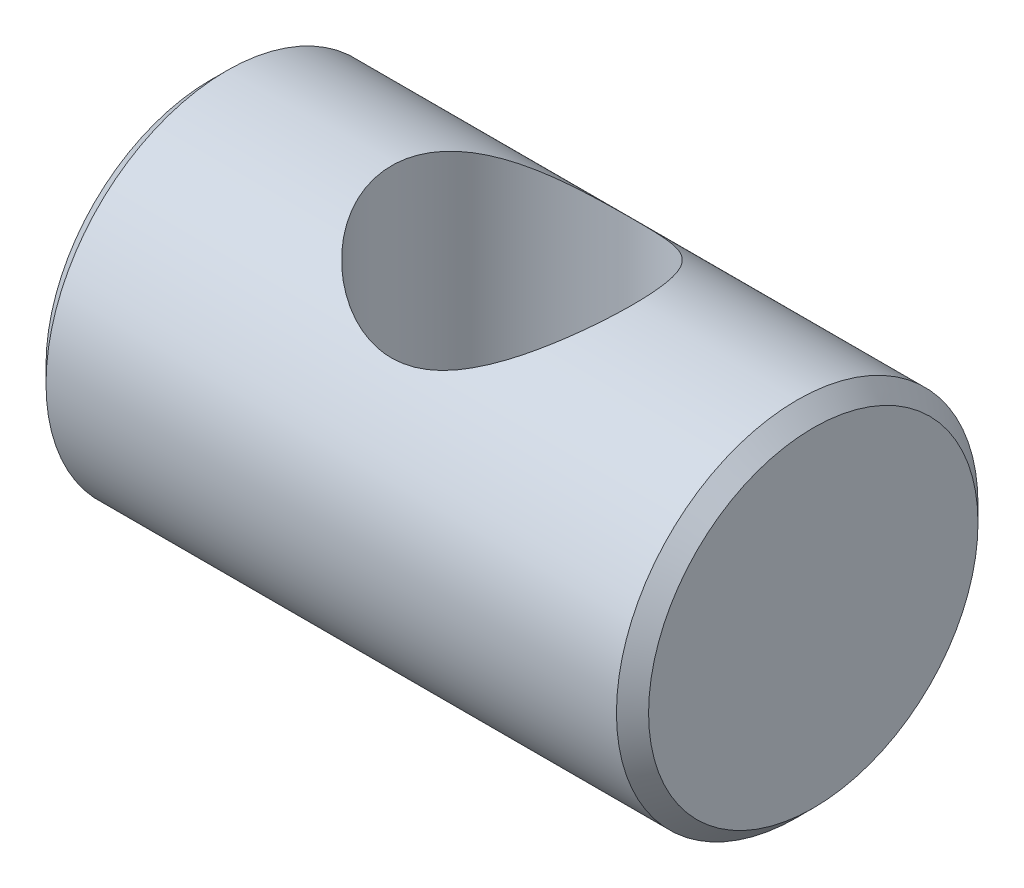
ISO-10303-21;
HEADER;
FILE_DESCRIPTION(('STEP AP214'),'2;1');
FILE_NAME('part.step','',(''),(''),'','','');
FILE_SCHEMA(('AUTOMOTIVE_DESIGN { 1 0 10303 214 1 1 1 1 }'));
ENDSEC;
DATA;
#1=APPLICATION_CONTEXT('core data for automotive mechanical design processes');
#2=APPLICATION_PROTOCOL_DEFINITION('international standard','automotive_design',2000,#1);
#3=PRODUCT_CONTEXT('',#1,'mechanical');
#4=PRODUCT('Part','Part','',(#3));
#5=PRODUCT_RELATED_PRODUCT_CATEGORY('part','',(#4));
#6=PRODUCT_DEFINITION_FORMATION('','',#4);
#7=PRODUCT_DEFINITION_CONTEXT('part definition',#1,'design');
#8=PRODUCT_DEFINITION('design','',#6,#7);
#9=PRODUCT_DEFINITION_SHAPE('','',#8);
#10=(LENGTH_UNIT() NAMED_UNIT(*) SI_UNIT(.MILLI.,.METRE.));
#11=(NAMED_UNIT(*) PLANE_ANGLE_UNIT() SI_UNIT($,.RADIAN.));
#12=(NAMED_UNIT(*) SI_UNIT($,.STERADIAN.) SOLID_ANGLE_UNIT());
#13=UNCERTAINTY_MEASURE_WITH_UNIT(LENGTH_MEASURE(1.E-05),#10,'distance_accuracy_value','');
#14=(GEOMETRIC_REPRESENTATION_CONTEXT(3) GLOBAL_UNCERTAINTY_ASSIGNED_CONTEXT((#13)) GLOBAL_UNIT_ASSIGNED_CONTEXT((#10,
#11,#12)) REPRESENTATION_CONTEXT('',''));
#15=CARTESIAN_POINT('',(0.,0.,0.));
#16=DIRECTION('',(0.,0.,1.));
#17=DIRECTION('',(1.,0.,0.));
#18=AXIS2_PLACEMENT_3D('',#15,#16,#17);
#19=CARTESIAN_POINT('',(7.5,4.1,0.));
#20=DIRECTION('',(-1.,0.,0.));
#21=DIRECTION('',(0.,0.,1.));
#22=AXIS2_PLACEMENT_3D('',#19,#20,#21);
#23=PLANE('',#22);
#24=CARTESIAN_POINT('',(7.49999999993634,0.,0.));
#25=DIRECTION('',(-1.,0.,0.));
#26=DIRECTION('',(0.,0.,1.));
#27=AXIS2_PLACEMENT_3D('',#24,#25,#26);
#28=CIRCLE('',#27,4.099999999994);
#29=CARTESIAN_POINT('',(7.49999999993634,0.,4.099999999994));
#30=VERTEX_POINT('',#29);
#31=EDGE_CURVE('E65',#30,#30,#28,.T.);
#32=ORIENTED_EDGE('',*,*,#31,.F.);
#33=EDGE_LOOP('',(#32));
#34=FACE_BOUND('',#33,.T.);
#35=ADVANCED_FACE('F12',(#34),#23,.F.);
#36=CARTESIAN_POINT('',(-7.5,0.,0.));
#37=DIRECTION('',(1.,0.,0.));
#38=DIRECTION('',(0.,0.,-1.));
#39=AXIS2_PLACEMENT_3D('',#36,#37,#38);
#40=PLANE('',#39);
#41=CARTESIAN_POINT('',(-7.49999999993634,0.,0.));
#42=DIRECTION('',(1.,0.,0.));
#43=DIRECTION('',(0.,0.,-1.));
#44=AXIS2_PLACEMENT_3D('',#41,#42,#43);
#45=CIRCLE('',#44,4.099999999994);
#46=CARTESIAN_POINT('',(-7.49999999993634,0.,-4.099999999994));
#47=VERTEX_POINT('',#46);
#48=EDGE_CURVE('E67',#47,#47,#45,.T.);
#49=ORIENTED_EDGE('',*,*,#48,.F.);
#50=EDGE_LOOP('',(#49));
#51=FACE_BOUND('',#50,.T.);
#52=ADVANCED_FACE('F54',(#51),#40,.F.);
#53=CARTESIAN_POINT('',(7.0999999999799,0.,0.));
#54=DIRECTION('',(-1.,0.,0.));
#55=DIRECTION('',(0.,0.,1.));
#56=AXIS2_PLACEMENT_3D('',#53,#54,#55);
#57=CONICAL_SURFACE('',#56,4.50000000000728,0.785398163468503);
#58=CARTESIAN_POINT('',(7.1,0.,0.));
#59=DIRECTION('',(1.,0.,0.));
#60=DIRECTION('',(0.,0.,-1.));
#61=AXIS2_PLACEMENT_3D('',#58,#59,#60);
#62=CIRCLE('',#61,4.5);
#63=CARTESIAN_POINT('',(7.1,0.,-4.5));
#64=VERTEX_POINT('',#63);
#65=EDGE_CURVE('E31',#64,#64,#62,.F.);
#66=ORIENTED_EDGE('',*,*,#65,.F.);
#67=EDGE_LOOP('',(#66));
#68=FACE_BOUND('',#67,.T.);
#69=ORIENTED_EDGE('',*,*,#31,.T.);
#70=EDGE_LOOP('',(#69));
#71=FACE_BOUND('',#70,.T.);
#72=ADVANCED_FACE('F61',(#68,#71),#57,.T.);
#73=CARTESIAN_POINT('',(-7.09999999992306,0.,0.));
#74=DIRECTION('',(1.,0.,0.));
#75=DIRECTION('',(0.,0.,-1.));
#76=AXIS2_PLACEMENT_3D('',#73,#74,#75);
#77=CONICAL_SURFACE('',#76,4.50000000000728,0.785398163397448);
#78=ORIENTED_EDGE('',*,*,#48,.T.);
#79=EDGE_LOOP('',(#78));
#80=FACE_BOUND('',#79,.T.);
#81=CARTESIAN_POINT('',(-7.1,0.,0.));
#82=DIRECTION('',(1.,0.,0.));
#83=DIRECTION('',(0.,0.,-1.));
#84=AXIS2_PLACEMENT_3D('',#81,#82,#83);
#85=CIRCLE('',#84,4.5);
#86=CARTESIAN_POINT('',(-7.1,0.,-4.5));
#87=VERTEX_POINT('',#86);
#88=EDGE_CURVE('E27',#87,#87,#85,.T.);
#89=ORIENTED_EDGE('',*,*,#88,.F.);
#90=EDGE_LOOP('',(#89));
#91=FACE_BOUND('',#90,.T.);
#92=ADVANCED_FACE('F51',(#80,#91),#77,.T.);
#93=CARTESIAN_POINT('',(7.5,0.,0.));
#94=DIRECTION('',(1.,0.,0.));
#95=DIRECTION('',(0.,0.,-1.));
#96=AXIS2_PLACEMENT_3D('',#93,#94,#95);
#97=CYLINDRICAL_SURFACE('',#96,4.5);
#98=CARTESIAN_POINT('',(3.,-4.5,0.));
#99=CARTESIAN_POINT('',(2.99999813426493,-4.49999851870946,0.15072164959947));
#100=CARTESIAN_POINT('',(2.98857832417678,-4.49236147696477,0.301452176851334));
#101=CARTESIAN_POINT('',(2.94360542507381,-4.46257035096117,0.59810104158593));
#102=CARTESIAN_POINT('',(2.91004182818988,-4.44040937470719,0.744017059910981));
#103=CARTESIAN_POINT('',(2.82283823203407,-4.38375708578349,1.02631807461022));
#104=CARTESIAN_POINT('',(2.76929223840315,-4.34932354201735,1.16274420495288));
#105=CARTESIAN_POINT('',(2.64440500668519,-4.27089210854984,1.42412304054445));
#106=CARTESIAN_POINT('',(2.57306118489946,-4.22689283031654,1.54907407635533));
#107=CARTESIAN_POINT('',(2.40801457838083,-4.12840992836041,1.7959270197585));
#108=CARTESIAN_POINT('',(2.31292820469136,-4.0733534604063,1.9166704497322));
#109=CARTESIAN_POINT('',(2.10640493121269,-3.95973469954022,2.14159207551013));
#110=CARTESIAN_POINT('',(1.99494460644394,-3.90116745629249,2.24574608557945));
#111=CARTESIAN_POINT('',(1.73842144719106,-3.7759239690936,2.45133446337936));
#112=CARTESIAN_POINT('',(1.59083151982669,-3.70942601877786,2.54974779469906));
#113=CARTESIAN_POINT('',(1.2774549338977,-3.58626221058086,2.72025535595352));
#114=CARTESIAN_POINT('',(1.11170039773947,-3.52957943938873,2.79239510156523));
#115=CARTESIAN_POINT('',(0.814933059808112,-3.44964399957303,2.8901105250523));
#116=CARTESIAN_POINT('',(0.687707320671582,-3.42146441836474,2.92311670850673));
#117=CARTESIAN_POINT('',(0.427883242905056,-3.37886954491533,2.97225926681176));
#118=CARTESIAN_POINT('',(0.29529457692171,-3.36443053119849,2.9884247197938));
#119=CARTESIAN_POINT('',(0.0277878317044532,-3.35154908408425,3.002870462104));
#120=CARTESIAN_POINT('',(-0.107137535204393,-3.35317203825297,3.00107764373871));
#121=CARTESIAN_POINT('',(-0.374452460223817,-3.37229663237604,2.97956372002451));
#122=CARTESIAN_POINT('',(-0.506839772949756,-3.3898117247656,2.95982742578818));
#123=CARTESIAN_POINT('',(-0.759700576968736,-3.43690778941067,2.90497491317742));
#124=CARTESIAN_POINT('',(-0.880442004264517,-3.46592232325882,2.87057567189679));
#125=CARTESIAN_POINT('',(-1.11453553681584,-3.53264434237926,2.78805177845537));
#126=CARTESIAN_POINT('',(-1.22788519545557,-3.57035468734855,2.73992260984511));
#127=CARTESIAN_POINT('',(-1.46853809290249,-3.65946294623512,2.62010728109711));
#128=CARTESIAN_POINT('',(-1.59398985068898,-3.7120847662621,2.54562078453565));
#129=CARTESIAN_POINT('',(-1.83207509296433,-3.82037306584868,2.3800344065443));
#130=CARTESIAN_POINT('',(-1.94469248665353,-3.8760432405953,2.28891403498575));
#131=CARTESIAN_POINT('',(-2.17881381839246,-3.9981501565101,2.06971747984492));
#132=CARTESIAN_POINT('',(-2.29700107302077,-4.06432117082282,1.93790907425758));
#133=CARTESIAN_POINT('',(-2.50979474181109,-4.18827150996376,1.65301199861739));
#134=CARTESIAN_POINT('',(-2.60442321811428,-4.24605866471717,1.49994344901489));
#135=CARTESIAN_POINT('',(-2.75021657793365,-4.33718106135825,1.20728674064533));
#136=CARTESIAN_POINT('',(-2.80626504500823,-4.37308891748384,1.07093646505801));
#137=CARTESIAN_POINT('',(-2.89815738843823,-4.43261578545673,0.789054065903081));
#138=CARTESIAN_POINT('',(-2.93401834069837,-4.45624518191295,0.643529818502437));
#139=CARTESIAN_POINT('',(-2.98374174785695,-4.48913823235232,0.346478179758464));
#140=CARTESIAN_POINT('',(-2.99750919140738,-4.49833983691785,0.194927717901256));
#141=CARTESIAN_POINT('',(-3.00187063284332,-4.50124672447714,-0.108662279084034));
#142=CARTESIAN_POINT('',(-2.99246625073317,-4.4949530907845,-0.260701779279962));
#143=CARTESIAN_POINT('',(-2.95256391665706,-4.46849384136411,-0.549683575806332));
#144=CARTESIAN_POINT('',(-2.92359405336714,-4.44933369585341,-0.686936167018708));
#145=CARTESIAN_POINT('',(-2.84760647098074,-4.39977673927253,-0.954174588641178));
#146=CARTESIAN_POINT('',(-2.80058587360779,-4.36937813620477,-1.08415925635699));
#147=CARTESIAN_POINT('',(-2.6870215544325,-4.29744528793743,-1.34199712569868));
#148=CARTESIAN_POINT('',(-2.61946776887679,-4.25534805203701,-1.46924427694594));
#149=CARTESIAN_POINT('',(-2.46835006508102,-4.16402783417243,-1.71102453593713));
#150=CARTESIAN_POINT('',(-2.38477625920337,-4.11480045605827,-1.82554972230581));
#151=CARTESIAN_POINT('',(-2.18908819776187,-4.00431819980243,-2.0577816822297));
#152=CARTESIAN_POINT('',(-2.07455060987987,-3.9423923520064,-2.17312781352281));
#153=CARTESIAN_POINT('',(-1.82833285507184,-3.81856759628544,-2.3840095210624));
#154=CARTESIAN_POINT('',(-1.69664094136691,-3.75666873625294,-2.47953140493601));
#155=CARTESIAN_POINT('',(-1.42928638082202,-3.64409518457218,-2.6418716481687));
#156=CARTESIAN_POINT('',(-1.29490194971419,-3.59291395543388,-2.71043454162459));
#157=CARTESIAN_POINT('',(-1.01419102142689,-3.50158461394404,-2.82744320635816));
#158=CARTESIAN_POINT('',(-0.867886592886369,-3.46141668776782,-2.87592518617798));
#159=CARTESIAN_POINT('',(-0.593153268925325,-3.4039981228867,-2.94353765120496));
#160=CARTESIAN_POINT('',(-0.466242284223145,-3.38392497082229,-2.96637896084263));
#161=CARTESIAN_POINT('',(-0.209140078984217,-3.35819199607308,-2.99548809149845));
#162=CARTESIAN_POINT('',(-0.0789525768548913,-3.35251651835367,-3.00177391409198));
#163=CARTESIAN_POINT('',(0.180964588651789,-3.3564630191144,-2.99735881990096));
#164=CARTESIAN_POINT('',(0.3106939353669,-3.36609405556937,-2.98664784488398));
#165=CARTESIAN_POINT('',(0.566015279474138,-3.39915677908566,-2.94895499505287));
#166=CARTESIAN_POINT('',(0.69160152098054,-3.42260687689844,-2.9219514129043));
#167=CARTESIAN_POINT('',(0.968566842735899,-3.48790269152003,-2.84389536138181));
#168=CARTESIAN_POINT('',(1.11790183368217,-3.53298514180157,-2.78835207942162));
#169=CARTESIAN_POINT('',(1.4032299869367,-3.63333227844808,-2.65626862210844));
#170=CARTESIAN_POINT('',(1.53920405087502,-3.68861122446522,-2.57969896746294));
#171=CARTESIAN_POINT('',(1.79892384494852,-3.80425832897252,-2.40597141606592));
#172=CARTESIAN_POINT('',(1.92240193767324,-3.86470080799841,-2.3084641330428));
#173=CARTESIAN_POINT('',(2.15297989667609,-3.98442252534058,-2.09508703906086));
#174=CARTESIAN_POINT('',(2.26007472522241,-4.04370140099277,-1.97921160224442));
#175=CARTESIAN_POINT('',(2.47008447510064,-4.16448181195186,-1.71214106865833));
#176=CARTESIAN_POINT('',(2.57019292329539,-4.22508104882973,-1.55826365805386));
#177=CARTESIAN_POINT('',(2.69899932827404,-4.30505398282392,-1.31299166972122));
#178=CARTESIAN_POINT('',(2.73837392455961,-4.32988963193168,-1.22882978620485));
#179=CARTESIAN_POINT('',(2.80946645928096,-4.37519698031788,-1.05622318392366));
#180=CARTESIAN_POINT('',(2.8411870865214,-4.39567021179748,-0.967779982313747));
#181=CARTESIAN_POINT('',(2.91169488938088,-4.44149572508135,-0.737227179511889));
#182=CARTESIAN_POINT('',(2.94465665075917,-4.4632644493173,-0.592538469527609));
#183=CARTESIAN_POINT('',(2.98880194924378,-4.49251195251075,-0.298567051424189));
#184=CARTESIAN_POINT('',(3.00000184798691,-4.50000146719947,-0.149287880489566));
#185=CARTESIAN_POINT('',(3.,-4.5,0.));
#186=B_SPLINE_CURVE_WITH_KNOTS('',3,(#98,#99,#100,#101,#102,#103,#104,#105,#106,#107,#108,#109,
#110,#111,#112,#113,#114,#115,#116,#117,#118,#119,#120,#121,#122,#123,#124,#125,#126,#127,#128,
#129,#130,#131,#132,#133,#134,#135,#136,#137,#138,#139,#140,#141,#142,#143,#144,#145,#146,#147,
#148,#149,#150,#151,#152,#153,#154,#155,#156,#157,#158,#159,#160,#161,#162,#163,#164,#165,#166,
#167,#168,#169,#170,#171,#172,#173,#174,#175,#176,#177,#178,#179,#180,#181,#182,#183,#184,#185),
.UNSPECIFIED.,.T.,.F.,(4,2,2,2,2,2,2,2,2,2,2,2,2,2,2,2,2,2,2,2,2,2,2,2,2,2,2,2,2,2,2,2,2,2,2,2,
2,2,2,2,2,2,2,4),(0.,0.4515798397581,0.903374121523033,1.35306922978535,1.8028296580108,
2.29075543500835,2.77938617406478,3.34510024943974,3.90982958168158,4.31150540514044,
4.71248651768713,5.11510067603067,5.51805595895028,5.90323293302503,6.28853675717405,
6.75221362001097,7.21646555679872,7.78078431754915,8.34457260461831,8.79786131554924,
9.25076602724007,9.70561324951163,10.1604286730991,10.583296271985,11.0062313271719,
11.4547852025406,11.9036168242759,12.4234226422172,12.9435862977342,13.419749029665,
13.8950493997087,14.2848607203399,14.6742480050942,15.0638658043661,15.4540038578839,
15.9480991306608,16.4428907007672,16.9466886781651,17.4506412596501,18.0269302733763,
18.3150447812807,18.603057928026,19.0506787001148,19.4979627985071),.UNSPECIFIED.);
#187=CARTESIAN_POINT('',(3.,-4.5,0.));
#188=VERTEX_POINT('',#187);
#189=EDGE_CURVE('E8',#188,#188,#186,.T.);
#190=ORIENTED_EDGE('',*,*,#189,.F.);
#191=EDGE_LOOP('',(#190));
#192=FACE_BOUND('',#191,.T.);
#193=CARTESIAN_POINT('',(0.,3.35410196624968,3.));
#194=CARTESIAN_POINT('',(0.0732569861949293,3.35409414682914,3.00000458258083));
#195=CARTESIAN_POINT('',(0.146481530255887,3.35651144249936,2.99731244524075));
#196=CARTESIAN_POINT('',(0.292242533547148,3.36602370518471,2.98662615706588));
#197=CARTESIAN_POINT('',(0.36477888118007,3.37311941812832,2.97863116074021));
#198=CARTESIAN_POINT('',(0.580557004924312,3.40099728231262,2.94687150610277));
#199=CARTESIAN_POINT('',(0.7218872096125,3.42836960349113,2.91533243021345));
#200=CARTESIAN_POINT('',(0.994135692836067,3.49584414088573,2.83403844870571));
#201=CARTESIAN_POINT('',(1.12514051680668,3.53582228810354,2.78446038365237));
#202=CARTESIAN_POINT('',(1.37678977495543,3.62376255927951,2.66901051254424));
#203=CARTESIAN_POINT('',(1.49743205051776,3.67172634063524,2.60313532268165));
#204=CARTESIAN_POINT('',(1.7454742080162,3.77919120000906,2.44503375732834));
#205=CARTESIAN_POINT('',(1.87100290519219,3.83932601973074,2.35030173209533));
#206=CARTESIAN_POINT('',(2.10599933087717,3.95917042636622,2.14229810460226));
#207=CARTESIAN_POINT('',(2.21545122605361,4.01887953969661,2.02900845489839));
#208=CARTESIAN_POINT('',(2.43098271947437,4.14134123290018,1.76719317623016));
#209=CARTESIAN_POINT('',(2.53429147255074,4.20328759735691,1.61594159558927));
#210=CARTESIAN_POINT('',(2.6683430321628,4.28588873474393,1.37421346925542));
#211=CARTESIAN_POINT('',(2.70954965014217,4.31170810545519,1.29113866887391));
#212=CARTESIAN_POINT('',(2.78442936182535,4.35915144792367,1.12054013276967));
#213=CARTESIAN_POINT('',(2.81810806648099,4.38077854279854,1.03301977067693));
#214=CARTESIAN_POINT('',(2.87404180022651,4.41698044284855,0.864225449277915));
#215=CARTESIAN_POINT('',(2.89715242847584,4.43207302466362,0.78334499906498));
#216=CARTESIAN_POINT('',(2.93658943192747,4.45795195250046,0.619315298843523));
#217=CARTESIAN_POINT('',(2.95291997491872,4.46874094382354,0.536167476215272));
#218=CARTESIAN_POINT('',(2.97850414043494,4.48568768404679,0.368381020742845));
#219=CARTESIAN_POINT('',(2.98776324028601,4.49184901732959,0.28374359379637));
#220=CARTESIAN_POINT('',(2.99905173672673,4.49936633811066,0.11380694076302));
#221=CARTESIAN_POINT('',(3.00108215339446,4.50072300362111,0.0285078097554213));
#222=CARTESIAN_POINT('',(2.99672182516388,4.49781194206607,-0.201115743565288));
#223=CARTESIAN_POINT('',(2.98351119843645,4.48898902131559,-0.345332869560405));
#224=CARTESIAN_POINT('',(2.93686864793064,4.45812769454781,-0.628886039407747));
#225=CARTESIAN_POINT('',(2.90343524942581,4.4360883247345,-0.768221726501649));
#226=CARTESIAN_POINT('',(2.81820508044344,4.38078005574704,-1.03810942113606));
#227=CARTESIAN_POINT('',(2.76648129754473,4.34755581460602,-1.16869392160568));
#228=CARTESIAN_POINT('',(2.64666991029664,4.27231692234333,-1.41931574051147));
#229=CARTESIAN_POINT('',(2.57857931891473,4.2303006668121,-1.53935112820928));
#230=CARTESIAN_POINT('',(2.41803177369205,4.13427076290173,-1.78242579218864));
#231=CARTESIAN_POINT('',(2.32354868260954,4.07940610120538,-1.90378704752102));
#232=CARTESIAN_POINT('',(2.11815201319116,3.9660090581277,-2.12998228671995));
#233=CARTESIAN_POINT('',(2.00721309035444,3.90747110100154,-2.23479025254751));
#234=CARTESIAN_POINT('',(1.75205517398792,3.78225066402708,-2.44158347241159));
#235=CARTESIAN_POINT('',(1.60534337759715,3.71571479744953,-2.54060388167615));
#236=CARTESIAN_POINT('',(1.29373524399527,3.59213416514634,-2.71252313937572));
#237=CARTESIAN_POINT('',(1.12887000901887,3.53507357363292,-2.78546578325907));
#238=CARTESIAN_POINT('',(0.83292140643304,3.45394305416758,-2.88499086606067));
#239=CARTESIAN_POINT('',(0.70560994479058,3.42510546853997,-2.91886187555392));
#240=CARTESIAN_POINT('',(0.445440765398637,3.381135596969,-2.96969333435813));
#241=CARTESIAN_POINT('',(0.312593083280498,3.36597955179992,-2.98668310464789));
#242=CARTESIAN_POINT('',(0.0443355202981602,3.35171335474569,-3.0026910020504));
#243=CARTESIAN_POINT('',(-0.0910829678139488,3.35267300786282,-3.0016309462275));
#244=CARTESIAN_POINT('',(-0.359525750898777,3.37064820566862,-2.98142444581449));
#245=CARTESIAN_POINT('',(-0.492548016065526,3.38767676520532,-2.96226334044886));
#246=CARTESIAN_POINT('',(-0.746084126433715,3.43391966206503,-2.90849716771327));
#247=CARTESIAN_POINT('',(-0.86689156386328,3.46249780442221,-2.87469261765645));
#248=CARTESIAN_POINT('',(-1.10118935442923,3.52844937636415,-2.79334562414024));
#249=CARTESIAN_POINT('',(-1.21467723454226,3.56582575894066,-2.74579856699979));
#250=CARTESIAN_POINT('',(-1.45530300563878,3.65417225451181,-2.6274501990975));
#251=CARTESIAN_POINT('',(-1.5806352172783,3.70636622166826,-2.55390043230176));
#252=CARTESIAN_POINT('',(-1.81862520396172,3.8139377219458,-2.39029097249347));
#253=CARTESIAN_POINT('',(-1.93126727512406,3.86931907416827,-2.30021117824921));
#254=CARTESIAN_POINT('',(-2.16594352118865,3.99113517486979,-2.08314986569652));
#255=CARTESIAN_POINT('',(-2.28465427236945,4.05734178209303,-1.95240579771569));
#256=CARTESIAN_POINT('',(-2.49872502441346,4.18163372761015,-1.6696492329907));
#257=CARTESIAN_POINT('',(-2.59410565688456,4.23972622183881,-1.51765571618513));
#258=CARTESIAN_POINT('',(-2.74183760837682,4.33186231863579,-1.226231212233));
#259=CARTESIAN_POINT('',(-2.79893475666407,4.36838187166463,-1.08999354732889));
#260=CARTESIAN_POINT('',(-2.89291079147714,4.4291806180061,-0.808135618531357));
#261=CARTESIAN_POINT('',(-2.929806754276,4.45347014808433,-0.6625233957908));
#262=CARTESIAN_POINT('',(-2.98154544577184,4.48767546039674,-0.365054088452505));
#263=CARTESIAN_POINT('',(-2.99629001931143,4.49752726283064,-0.213172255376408));
#264=CARTESIAN_POINT('',(-3.00247177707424,4.50164731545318,0.0912833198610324));
#265=CARTESIAN_POINT('',(-2.99391112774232,4.49591701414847,0.243856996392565));
#266=CARTESIAN_POINT('',(-2.95551076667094,4.47044333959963,0.533636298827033));
#267=CARTESIAN_POINT('',(-2.92726352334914,4.45174915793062,0.671152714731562));
#268=CARTESIAN_POINT('',(-2.8526429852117,4.40304159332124,0.939027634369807));
#269=CARTESIAN_POINT('',(-2.80626687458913,4.37302645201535,1.06938502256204));
#270=CARTESIAN_POINT('',(-2.69409194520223,4.3018764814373,1.32772094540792));
#271=CARTESIAN_POINT('',(-2.62732454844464,4.26019873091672,1.45512538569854));
#272=CARTESIAN_POINT('',(-2.47777402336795,4.16963112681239,1.69732899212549));
#273=CARTESIAN_POINT('',(-2.39498131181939,4.1207369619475,1.81212055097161));
#274=CARTESIAN_POINT('',(-2.20105668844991,4.01089395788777,2.04494134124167));
#275=CARTESIAN_POINT('',(-2.08751563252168,3.94925865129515,2.16064022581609));
#276=CARTESIAN_POINT('',(-1.84332951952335,3.82580042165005,2.37240030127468));
#277=CARTESIAN_POINT('',(-1.71267178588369,3.76397739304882,2.46844680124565));
#278=CARTESIAN_POINT('',(-1.44619919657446,3.65076300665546,2.63269891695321));
#279=CARTESIAN_POINT('',(-1.31153938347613,3.59893559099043,2.70247011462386));
#280=CARTESIAN_POINT('',(-1.0300712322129,3.50621323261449,2.82173662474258));
#281=CARTESIAN_POINT('',(-0.883287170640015,3.46529710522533,2.87127132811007));
#282=CARTESIAN_POINT('',(-0.613848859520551,3.40786372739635,2.93904512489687));
#283=CARTESIAN_POINT('',(-0.49305793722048,3.38794856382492,2.96178740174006));
#284=CARTESIAN_POINT('',(-0.248145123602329,3.36107964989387,2.99225476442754));
#285=CARTESIAN_POINT('',(-0.12402606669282,3.35411520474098,2.99999224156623));
#286=CARTESIAN_POINT('',(0.,3.35410196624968,3.));
#287=B_SPLINE_CURVE_WITH_KNOTS('',3,(#193,#194,#195,#196,#197,#198,#199,#200,#201,#202,#203,
#204,#205,#206,#207,#208,#209,#210,#211,#212,#213,#214,#215,#216,#217,#218,#219,#220,#221,#222,
#223,#224,#225,#226,#227,#228,#229,#230,#231,#232,#233,#234,#235,#236,#237,#238,#239,#240,#241,
#242,#243,#244,#245,#246,#247,#248,#249,#250,#251,#252,#253,#254,#255,#256,#257,#258,#259,#260,
#261,#262,#263,#264,#265,#266,#267,#268,#269,#270,#271,#272,#273,#274,#275,#276,#277,#278,#279,
#280,#281,#282,#283,#284,#285,#286),.UNSPECIFIED.,.T.,.F.,(4,2,2,2,2,2,2,2,2,2,2,2,2,2,2,2,2,2,
2,2,2,2,2,2,2,2,2,2,2,2,2,2,2,2,2,2,2,2,2,2,2,2,2,2,2,2,4),(0.,0.219620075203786,
0.439275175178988,0.878823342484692,1.31417375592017,1.749614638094,2.25283493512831,
2.75654755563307,3.33302024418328,3.62140722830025,3.90957854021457,4.16557735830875,
4.42141857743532,4.67706142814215,4.93266820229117,5.36561317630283,5.79858972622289,
6.22985763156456,6.6612043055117,7.14923304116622,7.63802137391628,8.20270070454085,
8.76642719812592,9.16941150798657,9.571694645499,9.97572071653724,10.3800743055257,
10.764666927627,11.1493888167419,11.6110086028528,12.0731935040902,12.636340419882,
13.1989875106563,13.653578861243,14.1077853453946,14.56399859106,15.0201694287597,
15.4431718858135,15.8662400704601,16.3137880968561,16.7616045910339,17.2798532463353,
17.7984879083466,18.2775320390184,18.7556392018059,19.1277693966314,19.4995921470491),.UNSPECIFIED.);
#288=CARTESIAN_POINT('',(0.,3.35410196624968,3.));
#289=VERTEX_POINT('',#288);
#290=EDGE_CURVE('E23',#289,#289,#287,.T.);
#291=ORIENTED_EDGE('',*,*,#290,.F.);
#292=EDGE_LOOP('',(#291));
#293=FACE_BOUND('',#292,.T.);
#294=ORIENTED_EDGE('',*,*,#88,.T.);
#295=EDGE_LOOP('',(#294));
#296=FACE_BOUND('',#295,.T.);
#297=ORIENTED_EDGE('',*,*,#65,.T.);
#298=EDGE_LOOP('',(#297));
#299=FACE_BOUND('',#298,.T.);
#300=ADVANCED_FACE('F39',(#192,#293,#296,#299),#97,.T.);
#301=CARTESIAN_POINT('',(0.,-4.5,0.));
#302=DIRECTION('',(0.,1.,0.));
#303=DIRECTION('',(0.,0.,1.));
#304=AXIS2_PLACEMENT_3D('',#301,#302,#303);
#305=CYLINDRICAL_SURFACE('',#304,3.);
#306=ORIENTED_EDGE('',*,*,#189,.T.);
#307=EDGE_LOOP('',(#306));
#308=FACE_BOUND('',#307,.T.);
#309=ORIENTED_EDGE('',*,*,#290,.T.);
#310=EDGE_LOOP('',(#309));
#311=FACE_BOUND('',#310,.T.);
#312=ADVANCED_FACE('F42',(#308,#311),#305,.F.);
#313=CLOSED_SHELL('',(#35,#52,#72,#92,#300,#312));
#314=MANIFOLD_SOLID_BREP('B1',#313);
#315=ADVANCED_BREP_SHAPE_REPRESENTATION('',(#18,#314),#14);
#316=SHAPE_DEFINITION_REPRESENTATION(#9,#315);
ENDSEC;
END-ISO-10303-21;
